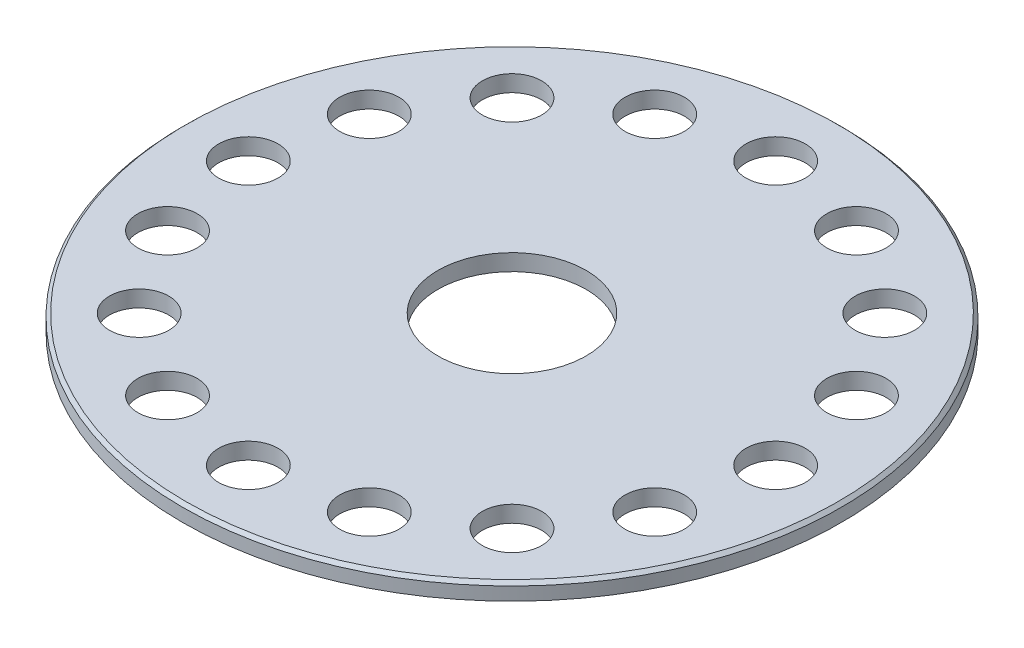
from build123d import *

# Parameters (mm, degrees)
SKETCH1_R           = 100
BOSS_EXTRUDE1_DEPTH = 5
SKETCH2_R           = 9
CUT_EXTRUDE1_DEPTH  = 142.509716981
CIRPATTERN1_COUNT   = 16
SKETCH4_R           = 22.5
CUT_EXTRUDE3_DEPTH  = 142.509716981
CHAMFER1_SIZE       = 1


with BuildPart() as part:
    # Sketch1 → Boss-Extrude1 (new body)
    with BuildSketch(Plane(origin=(0, 0, 0), x_dir=(1, 0, 0), z_dir=(0, 1, 0))):
        with Locations(Location((0, 0, 0), (0, 0, 270))):
            Circle(SKETCH1_R)
    extrude(amount=BOSS_EXTRUDE1_DEPTH)

    # Sketch2 → Cut-Extrude1 (cut, through all)
    with BuildSketch(Plane(origin=(0, 5, 0), x_dir=(1, 0, 0), z_dir=(0, 1, 0))):
        with Locations(Location((0, 80, 0), (0, 0, 270))):
            Circle(SKETCH2_R)
    cut_extrude1 = extrude(amount=-CUT_EXTRUDE1_DEPTH, mode=Mode.SUBTRACT)

    # CirPattern1: Cut-Extrude1 ×16 about axis
    cirpattern1_axis = Axis((0, 0, 0), (0, 1, 0))
    for i in range(1, CIRPATTERN1_COUNT):
        add(cut_extrude1.rotate(cirpattern1_axis, i * 360 / CIRPATTERN1_COUNT), mode=Mode.SUBTRACT)

    # Sketch4 → Cut-Extrude3 (cut, through all)
    with BuildSketch(Plane(origin=(0, 0, 0), x_dir=(-1, 0, 0), z_dir=(0, -1, 0))):
        with Locations(Location((0, 0, 0), (0, 0, 90))):
            Circle(SKETCH4_R)
    extrude(amount=-CUT_EXTRUDE3_DEPTH, mode=Mode.SUBTRACT)

    # Chamfer1
    chamfer1_edges = [part.edges().sort_by_distance(p)[0] for p in [
        (0, 5, -100),
    ]]
    chamfer(chamfer1_edges, length=CHAMFER1_SIZE)


solid = part.part
